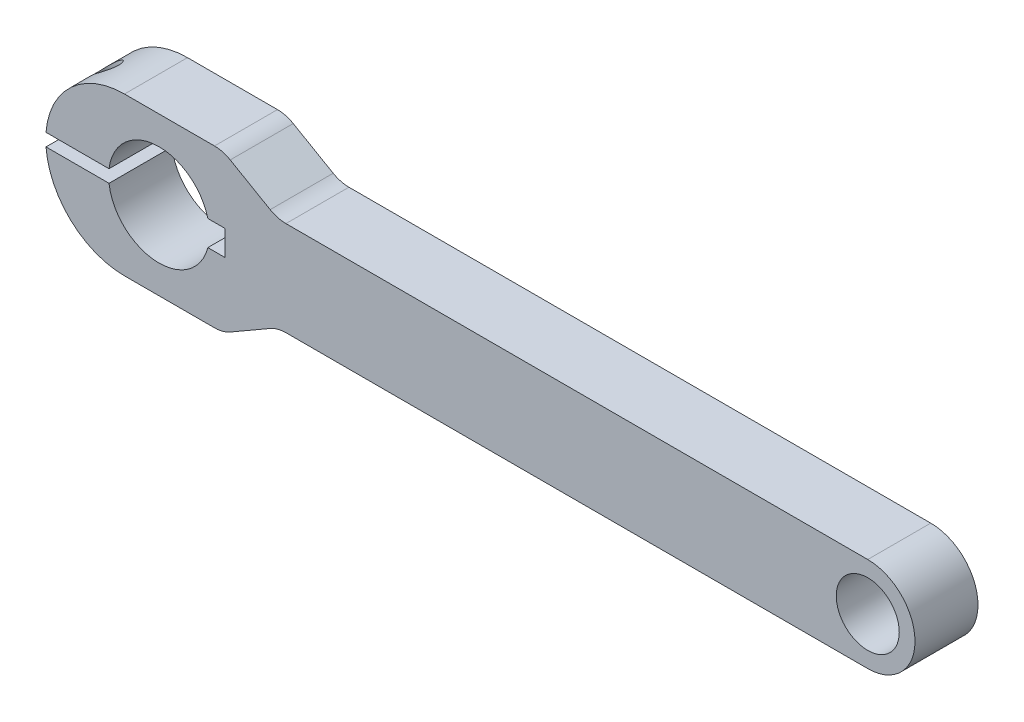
from build123d import *

# Parameters (mm, degrees)
ESQUISSE1_R             = 16
ESQUISSE1_R_2           = 10
BOSS_EXTRU_1_DEPTH      = 20
CONG_1_R                = 10
ESQUISSE2_W             = 29.871343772
ESQUISSE2_H             = 8
ENL_V_MAT_EXTRU_1_DEPTH = 384.442878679
BOSS_EXTRU_2_DEPTH      = 20
ESQUISSE4_W             = 24.009444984
ESQUISSE4_H             = 4
ENL_V_MAT_EXTRU_2_DEPTH = 20
ESQUISSE5_R             = 3.5
ENL_V_MAT_EXTRU_3_DEPTH = 36
ESQUISSE6_R             = 4.5
ENL_V_MAT_EXTRU_4_DEPTH = 36
ESQUISSE7_R             = 7
ENL_V_MAT_EXTRU_5_DEPTH = 36


with BuildPart() as part:
    # Esquisse1 → Boss.-Extru.1 (new body)
    with BuildSketch(Plane.XY):
        with BuildLine():
            Line((-262.391265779, 162.493064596), (-75, 162.493064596))
            ThreePointArc((-75, 162.493064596), (-60, 177.493064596), (-75, 192.493064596))
            Line((-75, 192.493064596), (-262.391265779, 192.493064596))
            Line((-262.391265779, 192.493064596), (-279.711773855, 202.493064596))
            Line((-279.711773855, 202.493064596), (-300, 202.493064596))
            ThreePointArc((-300, 202.493064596), (-325, 177.493064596), (-300, 152.493064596))
            Line((-300, 152.493064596), (-279.711773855, 152.493064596))
            Line((-279.711773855, 152.493064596), (-262.391265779, 162.493064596))
        make_face()
        with Locations((-300, 177.493064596)):
            Circle(ESQUISSE1_R, mode=Mode.SUBTRACT)
        with Locations((-75, 177.493064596)):
            Circle(ESQUISSE1_R_2, mode=Mode.SUBTRACT)
    extrude(amount=BOSS_EXTRU_1_DEPTH)

    # Cong_1
    cong_1_edges = [part.edges().sort_by_distance(p)[0] for p in [
        (-279.711773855, 202.493064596, 10),
        (-262.391265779, 192.493064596, 10),
        (-262.391265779, 162.493064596, 10),
        (-279.711773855, 152.493064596, 10),
    ]]
    fillet(cong_1_edges, radius=CONG_1_R)

    # Esquisse2 → Enl_v. mat.-Extru.1 (cut, through all)
    with BuildSketch(Plane.XY.offset(20)):
        with Locations((-293.935671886, 177.493064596)):
            Rectangle(ESQUISSE2_W, ESQUISSE2_H)
    extrude(amount=-ENL_V_MAT_EXTRU_1_DEPTH, mode=Mode.SUBTRACT)

    # Esquisse3 → Boss.-Extru.2 (add)
    with BuildSketch(Plane(origin=(0, 0, 0), x_dir=(-1, 0, 0), z_dir=(0, 0, -1))):
        with BuildLine():
            Line((310.960972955, 202.493064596), (294.879538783, 202.493064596))
            Line((294.879538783, 202.493064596), (293.738101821, 195.614121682))
            ThreePointArc((293.738101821, 195.614121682), (319.17248233, 177.493064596), (293.738101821, 159.372007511))
            Line((293.738101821, 159.372007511), (296.010264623, 152.493064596))
            Line((296.010264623, 152.493064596), (310.960972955, 152.493064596))
            ThreePointArc((310.960972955, 152.493064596), (335.960972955, 177.493064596), (310.960972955, 202.493064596))
        make_face()
    extrude(amount=-BOSS_EXTRU_2_DEPTH)

    # Esquisse4 → Enl_v. mat.-Extru.2 (cut)
    with BuildSketch(Plane(origin=(0, 0, 0), x_dir=(-1, 0, 0), z_dir=(0, 0, -1))):
        with Locations((326.099914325, 177.493064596)):
            Rectangle(ESQUISSE4_W, ESQUISSE4_H)
    extrude(amount=-ENL_V_MAT_EXTRU_2_DEPTH, mode=Mode.SUBTRACT)

    # Esquisse5 → Enl_v. mat.-Extru.3 (cut)
    with BuildSketch(Plane.XZ.offset(-179.493064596)):
        with Locations(Location((-326.297546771, 10, 0), (0, 0, 270))):
            Circle(ESQUISSE5_R)
    extrude(amount=-ENL_V_MAT_EXTRU_3_DEPTH, mode=Mode.SUBTRACT)

    # Esquisse6 → Enl_v. mat.-Extru.4 (cut)
    with BuildSketch(Plane(origin=(0, 175.493064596, 0), x_dir=(1, 0, 0), z_dir=(0, 1, 0))):
        with Locations(Location((-326.297546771, -10, 0), (0, 0, 270))):
            Circle(ESQUISSE6_R)
    extrude(amount=-ENL_V_MAT_EXTRU_4_DEPTH, mode=Mode.SUBTRACT)

    # Esquisse7 → Enl_v. mat.-Extru.5 (cut)
    with BuildSketch(Plane(origin=(0, 170.493064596, 0), x_dir=(-1, 0, 0), z_dir=(0, 1, 0))):
        with Locations(Location((326.297546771, 10, 0), (0, 0, 90))):
            Circle(ESQUISSE7_R)
    extrude(amount=-ENL_V_MAT_EXTRU_5_DEPTH, mode=Mode.SUBTRACT)


solid = part.part
